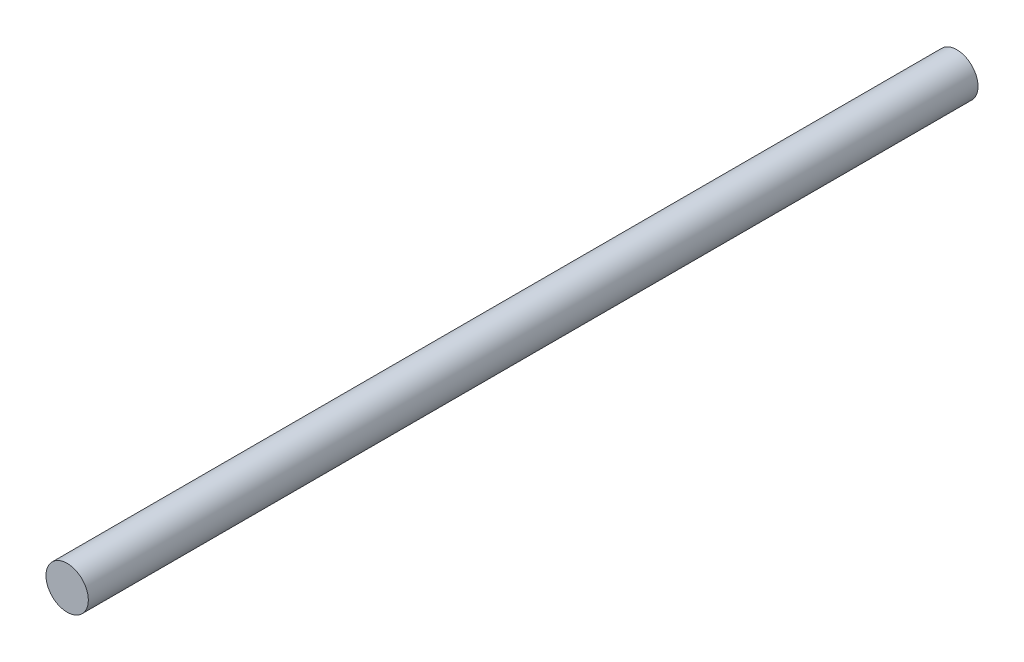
ISO-10303-21;
HEADER;
FILE_DESCRIPTION(('STEP AP214'),'2;1');
FILE_NAME('part.step','',(''),(''),'','','');
FILE_SCHEMA(('AUTOMOTIVE_DESIGN { 1 0 10303 214 1 1 1 1 }'));
ENDSEC;
DATA;
#1=APPLICATION_CONTEXT('core data for automotive mechanical design processes');
#2=APPLICATION_PROTOCOL_DEFINITION('international standard','automotive_design',2000,#1);
#3=PRODUCT_CONTEXT('',#1,'mechanical');
#4=PRODUCT('Part','Part','',(#3));
#5=PRODUCT_RELATED_PRODUCT_CATEGORY('part','',(#4));
#6=PRODUCT_DEFINITION_FORMATION('','',#4);
#7=PRODUCT_DEFINITION_CONTEXT('part definition',#1,'design');
#8=PRODUCT_DEFINITION('design','',#6,#7);
#9=PRODUCT_DEFINITION_SHAPE('','',#8);
#10=(LENGTH_UNIT() NAMED_UNIT(*) SI_UNIT(.MILLI.,.METRE.));
#11=(NAMED_UNIT(*) PLANE_ANGLE_UNIT() SI_UNIT($,.RADIAN.));
#12=(NAMED_UNIT(*) SI_UNIT($,.STERADIAN.) SOLID_ANGLE_UNIT());
#13=UNCERTAINTY_MEASURE_WITH_UNIT(LENGTH_MEASURE(1.E-05),#10,'distance_accuracy_value','');
#14=(GEOMETRIC_REPRESENTATION_CONTEXT(3) GLOBAL_UNCERTAINTY_ASSIGNED_CONTEXT((#13)) GLOBAL_UNIT_ASSIGNED_CONTEXT((#10,
#11,#12)) REPRESENTATION_CONTEXT('',''));
#15=CARTESIAN_POINT('',(0.,0.,0.));
#16=DIRECTION('',(0.,0.,1.));
#17=DIRECTION('',(1.,0.,0.));
#18=AXIS2_PLACEMENT_3D('',#15,#16,#17);
#19=CARTESIAN_POINT('',(0.,0.,266.7));
#20=DIRECTION('',(0.,0.,-1.));
#21=DIRECTION('',(-1.,0.,0.));
#22=AXIS2_PLACEMENT_3D('',#19,#20,#21);
#23=CYLINDRICAL_SURFACE('',#22,6.35);
#24=CARTESIAN_POINT('',(0.,0.,266.7));
#25=DIRECTION('',(0.,0.,1.));
#26=DIRECTION('',(1.,0.,0.));
#27=AXIS2_PLACEMENT_3D('',#24,#25,#26);
#28=CIRCLE('',#27,6.35);
#29=CARTESIAN_POINT('',(6.35,0.,266.7));
#30=VERTEX_POINT('',#29);
#31=EDGE_CURVE('E10',#30,#30,#28,.T.);
#32=ORIENTED_EDGE('',*,*,#31,.F.);
#33=EDGE_LOOP('',(#32));
#34=FACE_BOUND('',#33,.T.);
#35=CARTESIAN_POINT('',(0.,0.,0.));
#36=DIRECTION('',(0.,0.,1.));
#37=DIRECTION('',(1.,0.,0.));
#38=AXIS2_PLACEMENT_3D('',#35,#36,#37);
#39=CIRCLE('',#38,6.35);
#40=CARTESIAN_POINT('',(6.35,0.,0.));
#41=VERTEX_POINT('',#40);
#42=EDGE_CURVE('E34',#41,#41,#39,.T.);
#43=ORIENTED_EDGE('',*,*,#42,.T.);
#44=EDGE_LOOP('',(#43));
#45=FACE_BOUND('',#44,.T.);
#46=ADVANCED_FACE('F31',(#34,#45),#23,.T.);
#47=CARTESIAN_POINT('',(0.,0.,266.7));
#48=DIRECTION('',(0.,0.,1.));
#49=DIRECTION('',(1.,0.,0.));
#50=AXIS2_PLACEMENT_3D('',#47,#48,#49);
#51=PLANE('',#50);
#52=ORIENTED_EDGE('',*,*,#31,.T.);
#53=EDGE_LOOP('',(#52));
#54=FACE_BOUND('',#53,.T.);
#55=ADVANCED_FACE('F46',(#54),#51,.T.);
#56=CARTESIAN_POINT('',(0.,0.,0.));
#57=DIRECTION('',(0.,0.,1.));
#58=DIRECTION('',(1.,0.,0.));
#59=AXIS2_PLACEMENT_3D('',#56,#57,#58);
#60=PLANE('',#59);
#61=ORIENTED_EDGE('',*,*,#42,.F.);
#62=EDGE_LOOP('',(#61));
#63=FACE_BOUND('',#62,.T.);
#64=ADVANCED_FACE('F44',(#63),#60,.F.);
#65=CLOSED_SHELL('',(#46,#55,#64));
#66=MANIFOLD_SOLID_BREP('B2',#65);
#67=ADVANCED_BREP_SHAPE_REPRESENTATION('',(#18,#66),#14);
#68=SHAPE_DEFINITION_REPRESENTATION(#9,#67);
ENDSEC;
END-ISO-10303-21;
